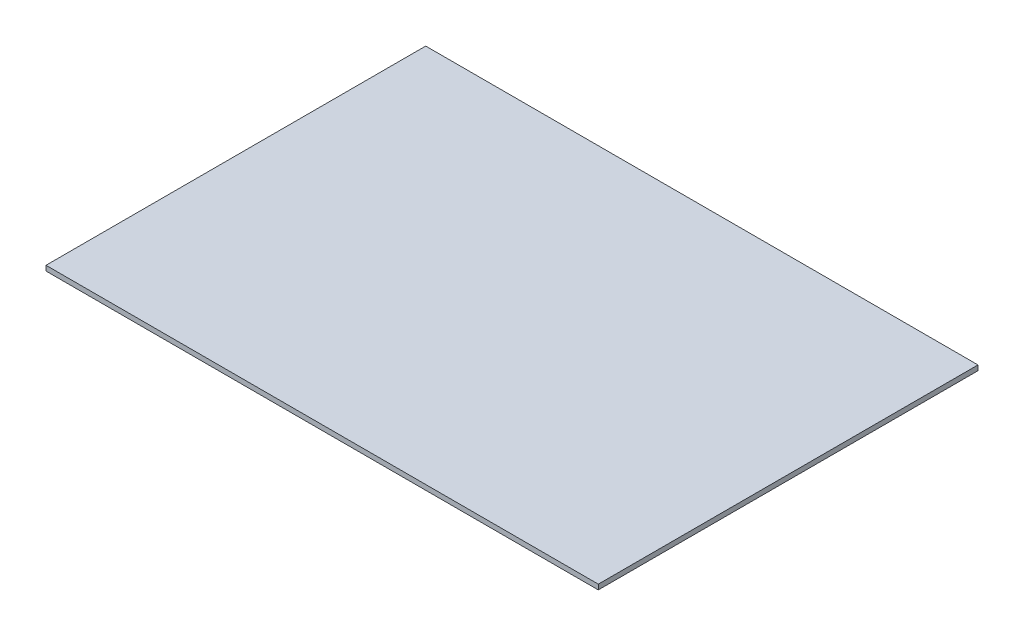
from build123d import *

# Parameters (mm, degrees)
SKETCH1_W           = 609.6
SKETCH1_H           = 419.1
BOSS_EXTRUDE1_DEPTH = 5.55625


with BuildPart() as part:
    # Sketch1 → Boss-Extrude1 (new body)
    with BuildSketch(Plane(origin=(0, 0, 0), x_dir=(1, 0, 0), z_dir=(0, 1, 0))):
        Rectangle(SKETCH1_W, SKETCH1_H)
    extrude(amount=BOSS_EXTRUDE1_DEPTH)


solid = part.part
